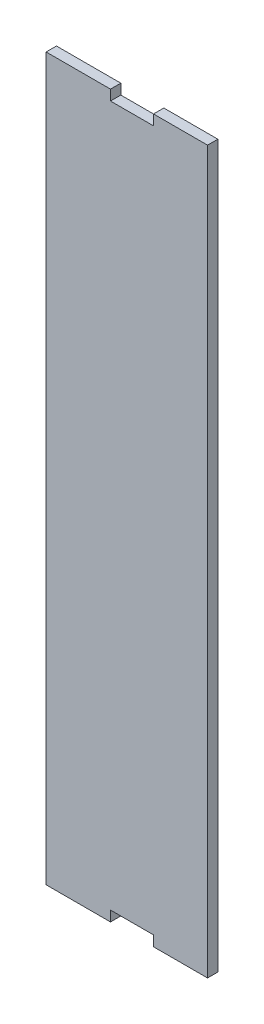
from build123d import *

# Parameters (mm, degrees)
BOSS_EXTRUDE1_DEPTH = 1.524


with BuildPart() as part:
    # Sketch1 → Boss-Extrude1 (new body)
    with BuildSketch(Plane.XY):
        Polygon((-5.014418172, 104.993300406), (-5.014418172, 103.469300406), (1.335581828, 103.469300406), (1.335581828, 104.993300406), (9.315574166, 104.993300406), (9.315574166, -1.524), (1.335581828, -1.524), (1.335581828, 0), (-5.014418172, 0), (-5.014418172, -1.524), (-14.51841051, -1.524), (-14.51841051, 104.993300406), align=None)
    extrude(amount=BOSS_EXTRUDE1_DEPTH)


solid = part.part
